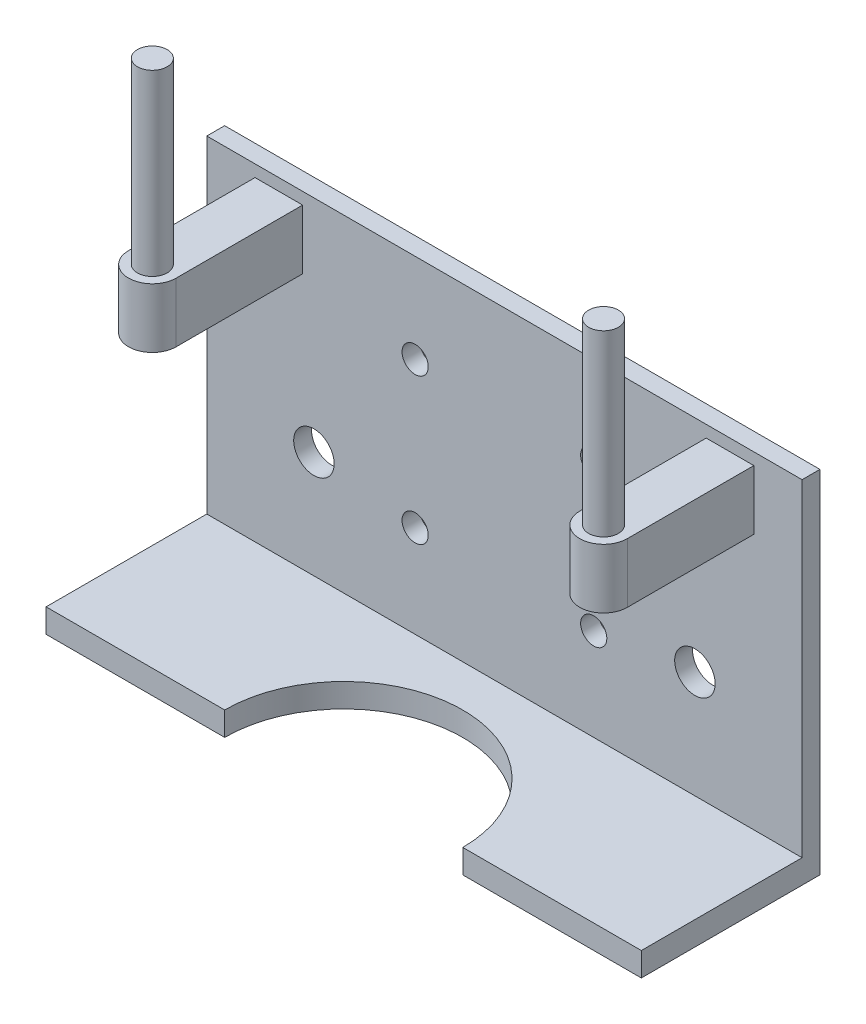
from build123d import *

# Parameters (mm, degrees)
SKETCH_1_W             = 100
SKETCH_1_H             = 55
EXTRUDE_1_DEPTH        = 3
SKETCH_2_W             = 100
SKETCH_2_H             = 30
EXTRUDE_2_DEPTH        = 4
EXTRUDE_START          = -2
EXTRUDE_3_DEPTH        = 10
SKETCH_4_R             = 2.5
EXTRUDE_4_DEPTH        = 30
HOLE_WIZARD_M8_1_D     = 6.8
HOLE_WIZARD_M8_1_DEPTH = 22.5
HOLE_WIZARD_M8_1_TIP   = 2.042926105
SKETCH_11_R            = 20
CUT_EXTRUDE_1_DEPTH    = 10
SKETCH_12_R            = 2.2
CUT_EXTRUDE_2_DEPTH    = 10


with BuildPart() as part:
    # Sketch 1 → Extrude 1 (new body)
    with BuildSketch(Plane.XY):
        Rectangle(SKETCH_1_W, SKETCH_1_H)
    extrude(amount=EXTRUDE_1_DEPTH)

    # Sketch 2 → Extrude 2 (add)
    with BuildSketch(Plane.XZ.offset(27.5)):
        with Locations((0, 15)):
            Rectangle(SKETCH_2_W, SKETCH_2_H)
    extrude(amount=EXTRUDE_2_DEPTH)

    # Sketch 3 → Extrude 3 (add)
    with BuildSketch(Plane(origin=(0, 27.5, 0), x_dir=(1, 0, 0), z_dir=(0, 1, 0)).offset(EXTRUDE_START)):
        with BuildLine():
            Line((41.9, -24.25), (41.9, -3))
            Line((41.9, -3), (33.9, -3))
            Line((33.9, -3), (33.9, -24.25))
            ThreePointArc((33.9, -24.25), (37.9, -28.25), (41.9, -24.25))
        make_face()
    extrude_3 = extrude(amount=-EXTRUDE_3_DEPTH)

    # Sketch 4 → Extrude 4 (add)
    with BuildSketch(Plane(origin=(0, 25.5, 0), x_dir=(1, 0, 0), z_dir=(0, 1, 0))):
        with Locations(Location((37.9, -24.25, 0), (0, 0, 180))):
            Circle(SKETCH_4_R)
    extrude_4 = extrude(amount=EXTRUDE_4_DEPTH)

    # Mirror 1: Extrude 3, Extrude 4 across plane
    add(extrude_3.mirror(Plane(origin=(0, 0, 0), x_dir=(0, 0, 1), z_dir=(1, 0, 0))))
    add(extrude_4.mirror(Plane(origin=(0, 0, 0), x_dir=(0, 0, 1), z_dir=(1, 0, 0))))

    # Hole Wizard M8 _1
    with Locations(Plane(origin=(-32, -9.5, 3), x_dir=(1, 0, 0), z_dir=(0, 0, 1))):
        with Locations((0, 0), (64, 0)):
            Hole(HOLE_WIZARD_M8_1_D / 2, depth=HOLE_WIZARD_M8_1_DEPTH)
            with Locations((0, 0, -(HOLE_WIZARD_M8_1_DEPTH + HOLE_WIZARD_M8_1_TIP / 2))):  # 118° drill point
                Cone(0, HOLE_WIZARD_M8_1_D / 2, HOLE_WIZARD_M8_1_TIP, mode=Mode.SUBTRACT)

    # Sketch 11 → Cut-Extrude 1 (cut)
    with BuildSketch(Plane.XZ.offset(31.5)):
        with Locations((0, 30)):
            Circle(SKETCH_11_R)
    extrude(amount=-CUT_EXTRUDE_1_DEPTH, mode=Mode.SUBTRACT)

    # Sketch 12 → Cut-Extrude 2 (cut)
    with BuildSketch(Plane.XY.offset(3)):
        with Locations((-15, -12)):
            Circle(SKETCH_12_R)
        with Locations((-15, 12.5)):
            Circle(SKETCH_12_R)
    cut_extrude_2 = extrude(amount=-CUT_EXTRUDE_2_DEPTH, mode=Mode.SUBTRACT)

    # Mirror 2: Cut-Extrude 2 across plane
    add(cut_extrude_2.mirror(Plane(origin=(0, 0, 0), x_dir=(0, 0, 1), z_dir=(1, 0, 0))), mode=Mode.SUBTRACT)


solid = part.part
